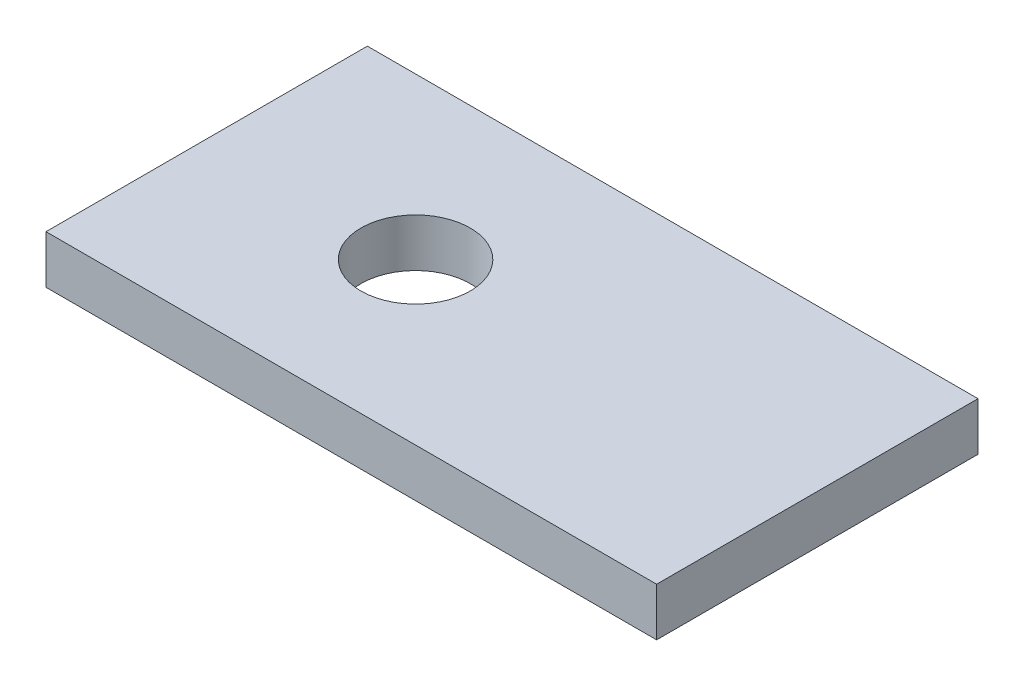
from build123d import *

# Parameters (mm, degrees)
SKETCH1_W         = 38
SKETCH1_H         = 20
EXTRUDE1_DEPTH    = 3
M8_TAPPED_HOLE1_D = 6.8


with BuildPart() as part:
    # Sketch1 → Extrude1 (new body)
    with BuildSketch(Plane(origin=(0, 0, 0), x_dir=(1, 0, 0), z_dir=(0, 1, 0))):
        with Locations((19, 10)):
            Rectangle(SKETCH1_W, SKETCH1_H)
    extrude(amount=EXTRUDE1_DEPTH)

    # M8 Tapped Hole1 (through all)
    with Locations(Plane(origin=(13, 3, -10), x_dir=(0, 0, 1), z_dir=(0, 1, 0))):
        with Locations((0, 0)):
            Hole(M8_TAPPED_HOLE1_D / 2)


solid = part.part
